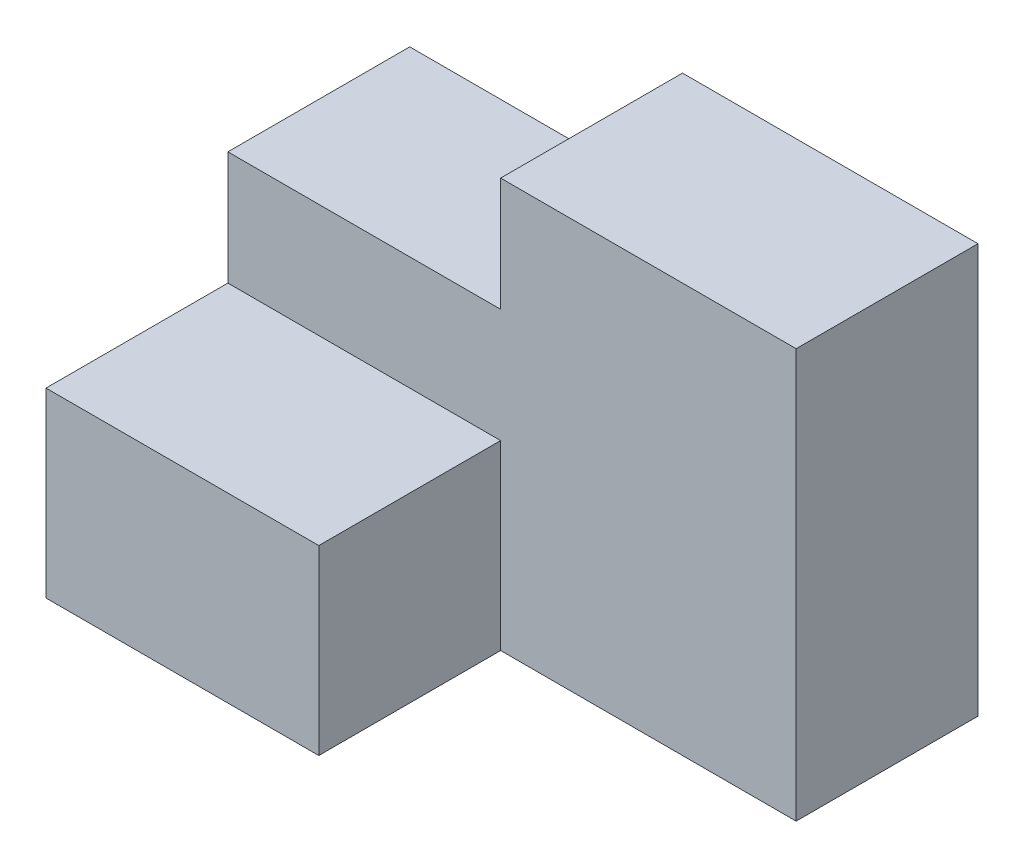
ISO-10303-21;
HEADER;
FILE_DESCRIPTION(('STEP AP214'),'2;1');
FILE_NAME('part.step','',(''),(''),'','','');
FILE_SCHEMA(('AUTOMOTIVE_DESIGN { 1 0 10303 214 1 1 1 1 }'));
ENDSEC;
DATA;
#1=APPLICATION_CONTEXT('core data for automotive mechanical design processes');
#2=APPLICATION_PROTOCOL_DEFINITION('international standard','automotive_design',2000,#1);
#3=PRODUCT_CONTEXT('',#1,'mechanical');
#4=PRODUCT('Part','Part','',(#3));
#5=PRODUCT_RELATED_PRODUCT_CATEGORY('part','',(#4));
#6=PRODUCT_DEFINITION_FORMATION('','',#4);
#7=PRODUCT_DEFINITION_CONTEXT('part definition',#1,'design');
#8=PRODUCT_DEFINITION('design','',#6,#7);
#9=PRODUCT_DEFINITION_SHAPE('','',#8);
#10=(LENGTH_UNIT() NAMED_UNIT(*) SI_UNIT(.MILLI.,.METRE.));
#11=(NAMED_UNIT(*) PLANE_ANGLE_UNIT() SI_UNIT($,.RADIAN.));
#12=(NAMED_UNIT(*) SI_UNIT($,.STERADIAN.) SOLID_ANGLE_UNIT());
#13=UNCERTAINTY_MEASURE_WITH_UNIT(LENGTH_MEASURE(1.E-05),#10,'distance_accuracy_value','');
#14=(GEOMETRIC_REPRESENTATION_CONTEXT(3) GLOBAL_UNCERTAINTY_ASSIGNED_CONTEXT((#13)) GLOBAL_UNIT_ASSIGNED_CONTEXT((#10,
#11,#12)) REPRESENTATION_CONTEXT('',''));
#15=CARTESIAN_POINT('',(0.,0.,0.));
#16=DIRECTION('',(0.,0.,1.));
#17=DIRECTION('',(1.,0.,0.));
#18=AXIS2_PLACEMENT_3D('',#15,#16,#17);
#19=CARTESIAN_POINT('',(0.,52.,32.));
#20=DIRECTION('',(0.,0.,-1.));
#21=DIRECTION('',(-1.,0.,0.));
#22=AXIS2_PLACEMENT_3D('',#19,#20,#21);
#23=PLANE('',#22);
#24=DIRECTION('',(-1.,0.,0.));
#25=VECTOR('',#24,1.);
#26=CARTESIAN_POINT('',(0.,32.,32.));
#27=LINE('',#26,#25);
#28=CARTESIAN_POINT('',(48.,32.,32.));
#29=VERTEX_POINT('',#28);
#30=CARTESIAN_POINT('',(0.,32.,32.));
#31=VERTEX_POINT('',#30);
#32=EDGE_CURVE('E124',#29,#31,#27,.T.);
#33=ORIENTED_EDGE('',*,*,#32,.F.);
#34=DIRECTION('',(0.,1.,0.));
#35=VECTOR('',#34,1.);
#36=CARTESIAN_POINT('',(48.,0.,32.));
#37=LINE('',#36,#35);
#38=CARTESIAN_POINT('',(48.,0.,32.));
#39=VERTEX_POINT('',#38);
#40=EDGE_CURVE('E48',#39,#29,#37,.T.);
#41=ORIENTED_EDGE('',*,*,#40,.F.);
#42=DIRECTION('',(1.,0.,0.));
#43=VECTOR('',#42,1.);
#44=CARTESIAN_POINT('',(0.,0.,32.));
#45=LINE('',#44,#43);
#46=CARTESIAN_POINT('',(100.,0.,32.));
#47=VERTEX_POINT('',#46);
#48=EDGE_CURVE('E148',#39,#47,#45,.T.);
#49=ORIENTED_EDGE('',*,*,#48,.T.);
#50=DIRECTION('',(0.,1.,0.));
#51=VECTOR('',#50,1.);
#52=CARTESIAN_POINT('',(100.,0.,32.));
#53=LINE('',#52,#51);
#54=CARTESIAN_POINT('',(100.,72.,32.));
#55=VERTEX_POINT('',#54);
#56=EDGE_CURVE('E151',#47,#55,#53,.T.);
#57=ORIENTED_EDGE('',*,*,#56,.T.);
#58=DIRECTION('',(-1.,0.,0.));
#59=VECTOR('',#58,1.);
#60=CARTESIAN_POINT('',(48.,72.,32.));
#61=LINE('',#60,#59);
#62=CARTESIAN_POINT('',(48.,72.,32.));
#63=VERTEX_POINT('',#62);
#64=EDGE_CURVE('E156',#55,#63,#61,.T.);
#65=ORIENTED_EDGE('',*,*,#64,.T.);
#66=DIRECTION('',(0.,-1.,0.));
#67=VECTOR('',#66,1.);
#68=CARTESIAN_POINT('',(48.,52.,32.));
#69=LINE('',#68,#67);
#70=CARTESIAN_POINT('',(48.,52.,32.));
#71=VERTEX_POINT('',#70);
#72=EDGE_CURVE('E158',#63,#71,#69,.T.);
#73=ORIENTED_EDGE('',*,*,#72,.T.);
#74=DIRECTION('',(-1.,0.,0.));
#75=VECTOR('',#74,1.);
#76=CARTESIAN_POINT('',(0.,52.,32.));
#77=LINE('',#76,#75);
#78=CARTESIAN_POINT('',(0.,52.,32.));
#79=VERTEX_POINT('',#78);
#80=EDGE_CURVE('E160',#71,#79,#77,.T.);
#81=ORIENTED_EDGE('',*,*,#80,.T.);
#82=DIRECTION('',(0.,-1.,0.));
#83=VECTOR('',#82,1.);
#84=CARTESIAN_POINT('',(0.,0.,32.));
#85=LINE('',#84,#83);
#86=EDGE_CURVE('E54',#79,#31,#85,.T.);
#87=ORIENTED_EDGE('',*,*,#86,.T.);
#88=EDGE_LOOP('',(#33,#41,#49,#57,#65,#73,#81,#87));
#89=FACE_BOUND('',#88,.T.);
#90=ADVANCED_FACE('F31',(#89),#23,.F.);
#91=CARTESIAN_POINT('',(0.,0.,32.));
#92=DIRECTION('',(1.,0.,0.));
#93=DIRECTION('',(0.,0.,-1.));
#94=AXIS2_PLACEMENT_3D('',#91,#92,#93);
#95=PLANE('',#94);
#96=DIRECTION('',(0.,-1.,0.));
#97=VECTOR('',#96,1.);
#98=CARTESIAN_POINT('',(0.,0.,0.));
#99=LINE('',#98,#97);
#100=CARTESIAN_POINT('',(0.,52.,0.));
#101=VERTEX_POINT('',#100);
#102=CARTESIAN_POINT('',(0.,0.,0.));
#103=VERTEX_POINT('',#102);
#104=EDGE_CURVE('E109',#101,#103,#99,.T.);
#105=ORIENTED_EDGE('',*,*,#104,.T.);
#106=DIRECTION('',(0.,0.,-1.));
#107=VECTOR('',#106,1.);
#108=CARTESIAN_POINT('',(0.,0.,32.));
#109=LINE('',#108,#107);
#110=CARTESIAN_POINT('',(0.,0.,64.));
#111=VERTEX_POINT('',#110);
#112=EDGE_CURVE('E11',#111,#103,#109,.T.);
#113=ORIENTED_EDGE('',*,*,#112,.F.);
#114=DIRECTION('',(0.,-1.,0.));
#115=VECTOR('',#114,1.);
#116=CARTESIAN_POINT('',(0.,0.,64.));
#117=LINE('',#116,#115);
#118=CARTESIAN_POINT('',(0.,32.,64.));
#119=VERTEX_POINT('',#118);
#120=EDGE_CURVE('E106',#119,#111,#117,.T.);
#121=ORIENTED_EDGE('',*,*,#120,.F.);
#122=DIRECTION('',(0.,0.,-1.));
#123=VECTOR('',#122,1.);
#124=CARTESIAN_POINT('',(0.,32.,64.));
#125=LINE('',#124,#123);
#126=EDGE_CURVE('E130',#119,#31,#125,.T.);
#127=ORIENTED_EDGE('',*,*,#126,.T.);
#128=ORIENTED_EDGE('',*,*,#86,.F.);
#129=DIRECTION('',(0.,0.,-1.));
#130=VECTOR('',#129,1.);
#131=CARTESIAN_POINT('',(0.,52.,32.));
#132=LINE('',#131,#130);
#133=EDGE_CURVE('E161',#79,#101,#132,.T.);
#134=ORIENTED_EDGE('',*,*,#133,.T.);
#135=EDGE_LOOP('',(#105,#113,#121,#127,#128,#134));
#136=FACE_BOUND('',#135,.T.);
#137=ADVANCED_FACE('F33',(#136),#95,.F.);
#138=CARTESIAN_POINT('',(0.,0.,32.));
#139=DIRECTION('',(0.,1.,0.));
#140=DIRECTION('',(0.,0.,1.));
#141=AXIS2_PLACEMENT_3D('',#138,#139,#140);
#142=PLANE('',#141);
#143=DIRECTION('',(1.,0.,0.));
#144=VECTOR('',#143,1.);
#145=CARTESIAN_POINT('',(0.,0.,0.));
#146=LINE('',#145,#144);
#147=CARTESIAN_POINT('',(100.,0.,0.));
#148=VERTEX_POINT('',#147);
#149=EDGE_CURVE('E142',#103,#148,#146,.T.);
#150=ORIENTED_EDGE('',*,*,#149,.T.);
#151=DIRECTION('',(0.,0.,-1.));
#152=VECTOR('',#151,1.);
#153=CARTESIAN_POINT('',(100.,0.,32.));
#154=LINE('',#153,#152);
#155=EDGE_CURVE('E40',#47,#148,#154,.T.);
#156=ORIENTED_EDGE('',*,*,#155,.F.);
#157=ORIENTED_EDGE('',*,*,#48,.F.);
#158=DIRECTION('',(0.,0.,-1.));
#159=VECTOR('',#158,1.);
#160=CARTESIAN_POINT('',(48.,0.,64.));
#161=LINE('',#160,#159);
#162=CARTESIAN_POINT('',(48.,0.,64.));
#163=VERTEX_POINT('',#162);
#164=EDGE_CURVE('E115',#163,#39,#161,.T.);
#165=ORIENTED_EDGE('',*,*,#164,.F.);
#166=DIRECTION('',(1.,0.,0.));
#167=VECTOR('',#166,1.);
#168=CARTESIAN_POINT('',(0.,0.,64.));
#169=LINE('',#168,#167);
#170=EDGE_CURVE('E112',#111,#163,#169,.T.);
#171=ORIENTED_EDGE('',*,*,#170,.F.);
#172=ORIENTED_EDGE('',*,*,#112,.T.);
#173=EDGE_LOOP('',(#150,#156,#157,#165,#171,#172));
#174=FACE_BOUND('',#173,.T.);
#175=ADVANCED_FACE('F113',(#174),#142,.F.);
#176=CARTESIAN_POINT('',(100.,0.,32.));
#177=DIRECTION('',(-1.,0.,0.));
#178=DIRECTION('',(0.,0.,1.));
#179=AXIS2_PLACEMENT_3D('',#176,#177,#178);
#180=PLANE('',#179);
#181=DIRECTION('',(0.,1.,0.));
#182=VECTOR('',#181,1.);
#183=CARTESIAN_POINT('',(100.,0.,0.));
#184=LINE('',#183,#182);
#185=CARTESIAN_POINT('',(100.,72.,0.));
#186=VERTEX_POINT('',#185);
#187=EDGE_CURVE('E164',#148,#186,#184,.T.);
#188=ORIENTED_EDGE('',*,*,#187,.T.);
#189=DIRECTION('',(0.,0.,-1.));
#190=VECTOR('',#189,1.);
#191=CARTESIAN_POINT('',(100.,72.,32.));
#192=LINE('',#191,#190);
#193=EDGE_CURVE('E179',#55,#186,#192,.T.);
#194=ORIENTED_EDGE('',*,*,#193,.F.);
#195=ORIENTED_EDGE('',*,*,#56,.F.);
#196=ORIENTED_EDGE('',*,*,#155,.T.);
#197=EDGE_LOOP('',(#188,#194,#195,#196));
#198=FACE_BOUND('',#197,.T.);
#199=ADVANCED_FACE('F187',(#198),#180,.F.);
#200=CARTESIAN_POINT('',(48.,72.,32.));
#201=DIRECTION('',(0.,-1.,0.));
#202=DIRECTION('',(0.,0.,-1.));
#203=AXIS2_PLACEMENT_3D('',#200,#201,#202);
#204=PLANE('',#203);
#205=DIRECTION('',(-1.,0.,0.));
#206=VECTOR('',#205,1.);
#207=CARTESIAN_POINT('',(48.,72.,0.));
#208=LINE('',#207,#206);
#209=CARTESIAN_POINT('',(48.,72.,0.));
#210=VERTEX_POINT('',#209);
#211=EDGE_CURVE('E166',#186,#210,#208,.T.);
#212=ORIENTED_EDGE('',*,*,#211,.T.);
#213=DIRECTION('',(0.,0.,-1.));
#214=VECTOR('',#213,1.);
#215=CARTESIAN_POINT('',(48.,72.,32.));
#216=LINE('',#215,#214);
#217=EDGE_CURVE('E176',#63,#210,#216,.T.);
#218=ORIENTED_EDGE('',*,*,#217,.F.);
#219=ORIENTED_EDGE('',*,*,#64,.F.);
#220=ORIENTED_EDGE('',*,*,#193,.T.);
#221=EDGE_LOOP('',(#212,#218,#219,#220));
#222=FACE_BOUND('',#221,.T.);
#223=ADVANCED_FACE('F196',(#222),#204,.F.);
#224=CARTESIAN_POINT('',(48.,52.,32.));
#225=DIRECTION('',(1.,0.,0.));
#226=DIRECTION('',(0.,0.,-1.));
#227=AXIS2_PLACEMENT_3D('',#224,#225,#226);
#228=PLANE('',#227);
#229=DIRECTION('',(0.,-1.,0.));
#230=VECTOR('',#229,1.);
#231=CARTESIAN_POINT('',(48.,52.,0.));
#232=LINE('',#231,#230);
#233=CARTESIAN_POINT('',(48.,52.,0.));
#234=VERTEX_POINT('',#233);
#235=EDGE_CURVE('E168',#210,#234,#232,.T.);
#236=ORIENTED_EDGE('',*,*,#235,.T.);
#237=DIRECTION('',(0.,0.,-1.));
#238=VECTOR('',#237,1.);
#239=CARTESIAN_POINT('',(48.,52.,32.));
#240=LINE('',#239,#238);
#241=EDGE_CURVE('E173',#71,#234,#240,.T.);
#242=ORIENTED_EDGE('',*,*,#241,.F.);
#243=ORIENTED_EDGE('',*,*,#72,.F.);
#244=ORIENTED_EDGE('',*,*,#217,.T.);
#245=EDGE_LOOP('',(#236,#242,#243,#244));
#246=FACE_BOUND('',#245,.T.);
#247=ADVANCED_FACE('F200',(#246),#228,.F.);
#248=CARTESIAN_POINT('',(0.,52.,32.));
#249=DIRECTION('',(0.,-1.,0.));
#250=DIRECTION('',(0.,0.,-1.));
#251=AXIS2_PLACEMENT_3D('',#248,#249,#250);
#252=PLANE('',#251);
#253=DIRECTION('',(-1.,0.,0.));
#254=VECTOR('',#253,1.);
#255=CARTESIAN_POINT('',(0.,52.,0.));
#256=LINE('',#255,#254);
#257=EDGE_CURVE('E170',#234,#101,#256,.T.);
#258=ORIENTED_EDGE('',*,*,#257,.T.);
#259=ORIENTED_EDGE('',*,*,#133,.F.);
#260=ORIENTED_EDGE('',*,*,#80,.F.);
#261=ORIENTED_EDGE('',*,*,#241,.T.);
#262=EDGE_LOOP('',(#258,#259,#260,#261));
#263=FACE_BOUND('',#262,.T.);
#264=ADVANCED_FACE('F205',(#263),#252,.F.);
#265=CARTESIAN_POINT('',(0.,52.,0.));
#266=DIRECTION('',(0.,0.,-1.));
#267=DIRECTION('',(-1.,0.,0.));
#268=AXIS2_PLACEMENT_3D('',#265,#266,#267);
#269=PLANE('',#268);
#270=ORIENTED_EDGE('',*,*,#104,.F.);
#271=ORIENTED_EDGE('',*,*,#257,.F.);
#272=ORIENTED_EDGE('',*,*,#235,.F.);
#273=ORIENTED_EDGE('',*,*,#211,.F.);
#274=ORIENTED_EDGE('',*,*,#187,.F.);
#275=ORIENTED_EDGE('',*,*,#149,.F.);
#276=EDGE_LOOP('',(#270,#271,#272,#273,#274,#275));
#277=FACE_BOUND('',#276,.T.);
#278=ADVANCED_FACE('F191',(#277),#269,.T.);
#279=CARTESIAN_POINT('',(48.,0.,64.));
#280=DIRECTION('',(-1.,0.,0.));
#281=DIRECTION('',(0.,0.,1.));
#282=AXIS2_PLACEMENT_3D('',#279,#280,#281);
#283=PLANE('',#282);
#284=ORIENTED_EDGE('',*,*,#40,.T.);
#285=DIRECTION('',(0.,0.,-1.));
#286=VECTOR('',#285,1.);
#287=CARTESIAN_POINT('',(48.,32.,64.));
#288=LINE('',#287,#286);
#289=CARTESIAN_POINT('',(48.,32.,64.));
#290=VERTEX_POINT('',#289);
#291=EDGE_CURVE('E133',#290,#29,#288,.T.);
#292=ORIENTED_EDGE('',*,*,#291,.F.);
#293=DIRECTION('',(0.,1.,0.));
#294=VECTOR('',#293,1.);
#295=CARTESIAN_POINT('',(48.,0.,64.));
#296=LINE('',#295,#294);
#297=EDGE_CURVE('E118',#163,#290,#296,.T.);
#298=ORIENTED_EDGE('',*,*,#297,.F.);
#299=ORIENTED_EDGE('',*,*,#164,.T.);
#300=EDGE_LOOP('',(#284,#292,#298,#299));
#301=FACE_BOUND('',#300,.T.);
#302=ADVANCED_FACE('F212',(#301),#283,.F.);
#303=CARTESIAN_POINT('',(0.,32.,64.));
#304=DIRECTION('',(0.,-1.,0.));
#305=DIRECTION('',(0.,0.,-1.));
#306=AXIS2_PLACEMENT_3D('',#303,#304,#305);
#307=PLANE('',#306);
#308=ORIENTED_EDGE('',*,*,#32,.T.);
#309=ORIENTED_EDGE('',*,*,#126,.F.);
#310=DIRECTION('',(-1.,0.,0.));
#311=VECTOR('',#310,1.);
#312=CARTESIAN_POINT('',(0.,32.,64.));
#313=LINE('',#312,#311);
#314=EDGE_CURVE('E122',#290,#119,#313,.T.);
#315=ORIENTED_EDGE('',*,*,#314,.F.);
#316=ORIENTED_EDGE('',*,*,#291,.T.);
#317=EDGE_LOOP('',(#308,#309,#315,#316));
#318=FACE_BOUND('',#317,.T.);
#319=ADVANCED_FACE('F223',(#318),#307,.F.);
#320=CARTESIAN_POINT('',(0.,32.,64.));
#321=DIRECTION('',(0.,0.,-1.));
#322=DIRECTION('',(-1.,0.,0.));
#323=AXIS2_PLACEMENT_3D('',#320,#321,#322);
#324=PLANE('',#323);
#325=ORIENTED_EDGE('',*,*,#120,.T.);
#326=ORIENTED_EDGE('',*,*,#170,.T.);
#327=ORIENTED_EDGE('',*,*,#297,.T.);
#328=ORIENTED_EDGE('',*,*,#314,.T.);
#329=EDGE_LOOP('',(#325,#326,#327,#328));
#330=FACE_BOUND('',#329,.T.);
#331=ADVANCED_FACE('F120',(#330),#324,.F.);
#332=CLOSED_SHELL('',(#90,#137,#175,#199,#223,#247,#264,#278,#302,#319,#331));
#333=MANIFOLD_SOLID_BREP('B2',#332);
#334=ADVANCED_BREP_SHAPE_REPRESENTATION('',(#18,#333),#14);
#335=SHAPE_DEFINITION_REPRESENTATION(#9,#334);
ENDSEC;
END-ISO-10303-21;
